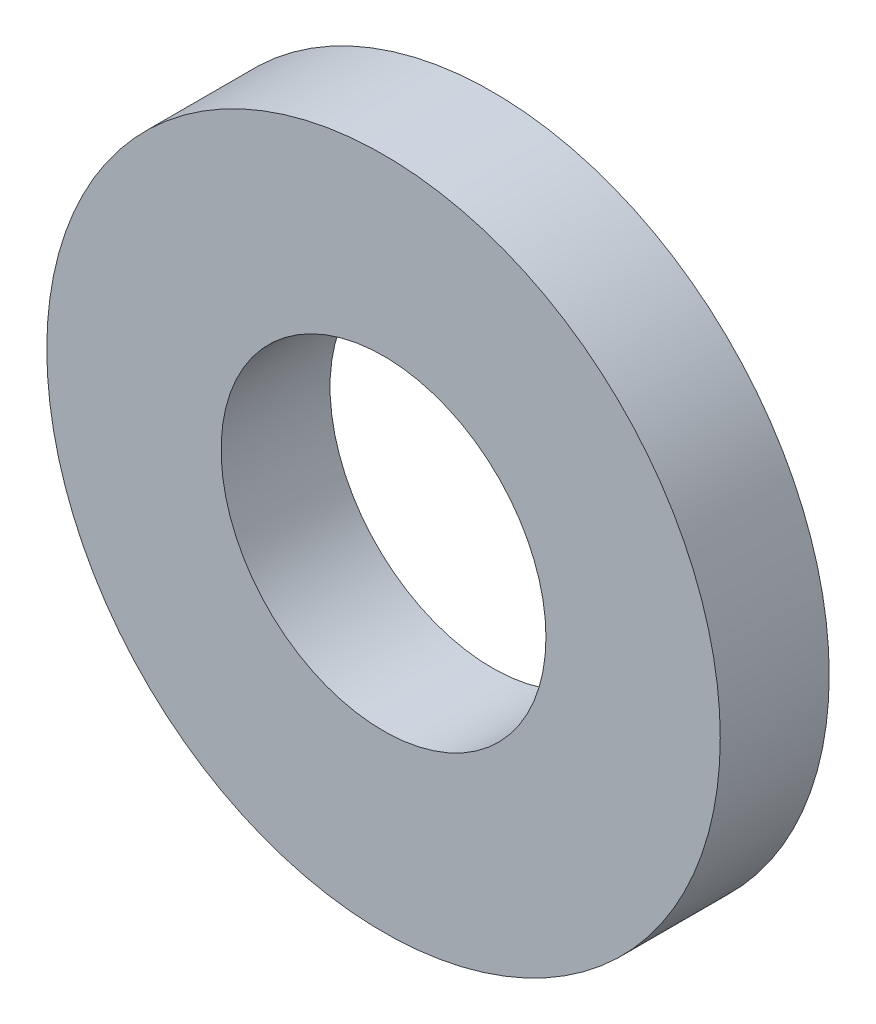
ISO-10303-21;
HEADER;
FILE_DESCRIPTION(('STEP AP214'),'2;1');
FILE_NAME('part.step','',(''),(''),'','','');
FILE_SCHEMA(('AUTOMOTIVE_DESIGN { 1 0 10303 214 1 1 1 1 }'));
ENDSEC;
DATA;
#1=APPLICATION_CONTEXT('core data for automotive mechanical design processes');
#2=APPLICATION_PROTOCOL_DEFINITION('international standard','automotive_design',2000,#1);
#3=PRODUCT_CONTEXT('',#1,'mechanical');
#4=PRODUCT('Part','Part','',(#3));
#5=PRODUCT_RELATED_PRODUCT_CATEGORY('part','',(#4));
#6=PRODUCT_DEFINITION_FORMATION('','',#4);
#7=PRODUCT_DEFINITION_CONTEXT('part definition',#1,'design');
#8=PRODUCT_DEFINITION('design','',#6,#7);
#9=PRODUCT_DEFINITION_SHAPE('','',#8);
#10=(LENGTH_UNIT() NAMED_UNIT(*) SI_UNIT(.MILLI.,.METRE.));
#11=(NAMED_UNIT(*) PLANE_ANGLE_UNIT() SI_UNIT($,.RADIAN.));
#12=(NAMED_UNIT(*) SI_UNIT($,.STERADIAN.) SOLID_ANGLE_UNIT());
#13=UNCERTAINTY_MEASURE_WITH_UNIT(LENGTH_MEASURE(1.E-05),#10,'distance_accuracy_value','');
#14=(GEOMETRIC_REPRESENTATION_CONTEXT(3) GLOBAL_UNCERTAINTY_ASSIGNED_CONTEXT((#13)) GLOBAL_UNIT_ASSIGNED_CONTEXT((#10,
#11,#12)) REPRESENTATION_CONTEXT('',''));
#15=CARTESIAN_POINT('',(0.,0.,0.));
#16=DIRECTION('',(0.,0.,1.));
#17=DIRECTION('',(1.,0.,0.));
#18=AXIS2_PLACEMENT_3D('',#15,#16,#17);
#19=CARTESIAN_POINT('',(0.,0.,2.75));
#20=DIRECTION('',(0.,0.,-1.));
#21=DIRECTION('',(-1.,0.,0.));
#22=AXIS2_PLACEMENT_3D('',#19,#20,#21);
#23=PLANE('',#22);
#24=CARTESIAN_POINT('',(0.,0.,2.75));
#25=DIRECTION('',(0.,0.,1.));
#26=DIRECTION('',(1.,0.,0.));
#27=AXIS2_PLACEMENT_3D('',#24,#25,#26);
#28=CIRCLE('',#27,4.1);
#29=CARTESIAN_POINT('',(4.1,0.,2.75));
#30=VERTEX_POINT('',#29);
#31=EDGE_CURVE('E26',#30,#30,#28,.F.);
#32=ORIENTED_EDGE('',*,*,#31,.T.);
#33=EDGE_LOOP('',(#32));
#34=FACE_BOUND('',#33,.T.);
#35=CARTESIAN_POINT('',(0.,0.,2.75));
#36=DIRECTION('',(0.,0.,1.));
#37=DIRECTION('',(1.,0.,0.));
#38=AXIS2_PLACEMENT_3D('',#35,#36,#37);
#39=CIRCLE('',#38,8.5);
#40=CARTESIAN_POINT('',(8.5,0.,2.75));
#41=VERTEX_POINT('',#40);
#42=EDGE_CURVE('E17',#41,#41,#39,.F.);
#43=ORIENTED_EDGE('',*,*,#42,.F.);
#44=EDGE_LOOP('',(#43));
#45=FACE_BOUND('',#44,.T.);
#46=ADVANCED_FACE('F14',(#34,#45),#23,.F.);
#47=CARTESIAN_POINT('',(0.,0.,0.));
#48=DIRECTION('',(0.,0.,1.));
#49=DIRECTION('',(1.,0.,0.));
#50=AXIS2_PLACEMENT_3D('',#47,#48,#49);
#51=CYLINDRICAL_SURFACE('',#50,8.5);
#52=CARTESIAN_POINT('',(0.,0.,0.));
#53=DIRECTION('',(0.,0.,1.));
#54=DIRECTION('',(1.,0.,0.));
#55=AXIS2_PLACEMENT_3D('',#52,#53,#54);
#56=CIRCLE('',#55,8.5);
#57=CARTESIAN_POINT('',(8.5,0.,0.));
#58=VERTEX_POINT('',#57);
#59=EDGE_CURVE('E21',#58,#58,#56,.F.);
#60=ORIENTED_EDGE('',*,*,#59,.F.);
#61=EDGE_LOOP('',(#60));
#62=FACE_BOUND('',#61,.T.);
#63=ORIENTED_EDGE('',*,*,#42,.T.);
#64=EDGE_LOOP('',(#63));
#65=FACE_BOUND('',#64,.T.);
#66=ADVANCED_FACE('F34',(#62,#65),#51,.T.);
#67=CARTESIAN_POINT('',(0.,0.,0.));
#68=DIRECTION('',(0.,0.,1.));
#69=DIRECTION('',(1.,0.,0.));
#70=AXIS2_PLACEMENT_3D('',#67,#68,#69);
#71=CYLINDRICAL_SURFACE('',#70,4.1);
#72=CARTESIAN_POINT('',(0.,0.,0.));
#73=DIRECTION('',(0.,0.,1.));
#74=DIRECTION('',(1.,0.,0.));
#75=AXIS2_PLACEMENT_3D('',#72,#73,#74);
#76=CIRCLE('',#75,4.1);
#77=CARTESIAN_POINT('',(4.1,0.,0.));
#78=VERTEX_POINT('',#77);
#79=EDGE_CURVE('E10',#78,#78,#76,.T.);
#80=ORIENTED_EDGE('',*,*,#79,.F.);
#81=EDGE_LOOP('',(#80));
#82=FACE_BOUND('',#81,.T.);
#83=ORIENTED_EDGE('',*,*,#31,.F.);
#84=EDGE_LOOP('',(#83));
#85=FACE_BOUND('',#84,.T.);
#86=ADVANCED_FACE('F41',(#82,#85),#71,.F.);
#87=CARTESIAN_POINT('',(0.,0.,0.));
#88=DIRECTION('',(0.,0.,-1.));
#89=DIRECTION('',(-1.,0.,0.));
#90=AXIS2_PLACEMENT_3D('',#87,#88,#89);
#91=PLANE('',#90);
#92=ORIENTED_EDGE('',*,*,#79,.T.);
#93=EDGE_LOOP('',(#92));
#94=FACE_BOUND('',#93,.T.);
#95=ORIENTED_EDGE('',*,*,#59,.T.);
#96=EDGE_LOOP('',(#95));
#97=FACE_BOUND('',#96,.T.);
#98=ADVANCED_FACE('F43',(#94,#97),#91,.T.);
#99=CLOSED_SHELL('',(#46,#66,#86,#98));
#100=MANIFOLD_SOLID_BREP('B1',#99);
#101=ADVANCED_BREP_SHAPE_REPRESENTATION('',(#18,#100),#14);
#102=SHAPE_DEFINITION_REPRESENTATION(#9,#101);
ENDSEC;
END-ISO-10303-21;
